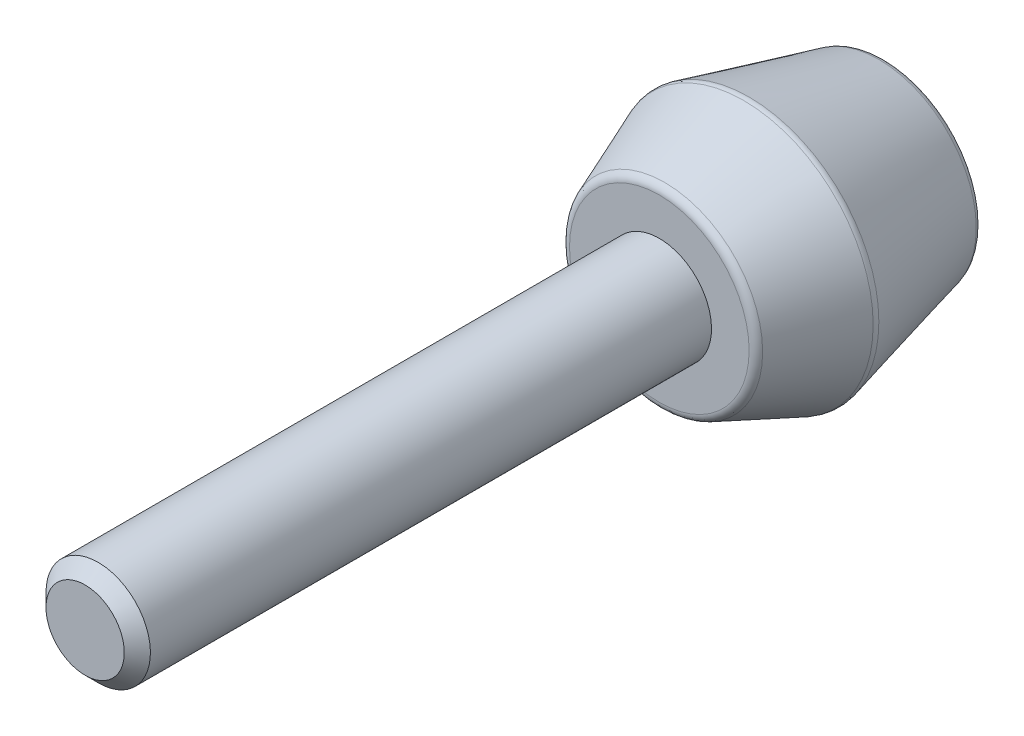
ISO-10303-21;
HEADER;
FILE_DESCRIPTION(('STEP AP214'),'2;1');
FILE_NAME('part.step','',(''),(''),'','','');
FILE_SCHEMA(('AUTOMOTIVE_DESIGN { 1 0 10303 214 1 1 1 1 }'));
ENDSEC;
DATA;
#1=APPLICATION_CONTEXT('core data for automotive mechanical design processes');
#2=APPLICATION_PROTOCOL_DEFINITION('international standard','automotive_design',2000,#1);
#3=PRODUCT_CONTEXT('',#1,'mechanical');
#4=PRODUCT('Part','Part','',(#3));
#5=PRODUCT_RELATED_PRODUCT_CATEGORY('part','',(#4));
#6=PRODUCT_DEFINITION_FORMATION('','',#4);
#7=PRODUCT_DEFINITION_CONTEXT('part definition',#1,'design');
#8=PRODUCT_DEFINITION('design','',#6,#7);
#9=PRODUCT_DEFINITION_SHAPE('','',#8);
#10=(LENGTH_UNIT() NAMED_UNIT(*) SI_UNIT(.MILLI.,.METRE.));
#11=(NAMED_UNIT(*) PLANE_ANGLE_UNIT() SI_UNIT($,.RADIAN.));
#12=(NAMED_UNIT(*) SI_UNIT($,.STERADIAN.) SOLID_ANGLE_UNIT());
#13=UNCERTAINTY_MEASURE_WITH_UNIT(LENGTH_MEASURE(1.E-05),#10,'distance_accuracy_value','');
#14=(GEOMETRIC_REPRESENTATION_CONTEXT(3) GLOBAL_UNCERTAINTY_ASSIGNED_CONTEXT((#13)) GLOBAL_UNIT_ASSIGNED_CONTEXT((#10,
#11,#12)) REPRESENTATION_CONTEXT('',''));
#15=CARTESIAN_POINT('',(0.,0.,0.));
#16=DIRECTION('',(0.,0.,1.));
#17=DIRECTION('',(1.,0.,0.));
#18=AXIS2_PLACEMENT_3D('',#15,#16,#17);
#19=CARTESIAN_POINT('',(0.,0.,0.));
#20=DIRECTION('',(0.,0.,-1.));
#21=DIRECTION('',(0.,1.,0.));
#22=AXIS2_PLACEMENT_3D('',#19,#20,#21);
#23=PLANE('',#22);
#24=CARTESIAN_POINT('',(0.,0.,0.));
#25=DIRECTION('',(0.,0.,1.));
#26=DIRECTION('',(0.,1.,0.));
#27=AXIS2_PLACEMENT_3D('',#24,#25,#26);
#28=CIRCLE('',#27,5.10961179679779);
#29=CARTESIAN_POINT('',(0.,5.10961179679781,0.));
#30=VERTEX_POINT('',#29);
#31=CARTESIAN_POINT('',(0.,-5.10961179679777,0.));
#32=VERTEX_POINT('',#31);
#33=EDGE_CURVE('E46',#30,#32,#28,.T.);
#34=ORIENTED_EDGE('',*,*,#33,.F.);
#35=CARTESIAN_POINT('',(0.,0.,0.));
#36=DIRECTION('',(0.,0.,1.));
#37=DIRECTION('',(0.,-1.,0.));
#38=AXIS2_PLACEMENT_3D('',#35,#36,#37);
#39=CIRCLE('',#38,5.10961179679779);
#40=EDGE_CURVE('E42',#32,#30,#39,.T.);
#41=ORIENTED_EDGE('',*,*,#40,.F.);
#42=EDGE_LOOP('',(#34,#41));
#43=FACE_BOUND('',#42,.T.);
#44=ADVANCED_FACE('F14',(#43),#23,.T.);
#45=CARTESIAN_POINT('',(0.,0.,0.499999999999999));
#46=DIRECTION('',(0.,0.,-1.));
#47=DIRECTION('',(0.,1.,0.));
#48=AXIS2_PLACEMENT_3D('',#45,#46,#47);
#49=TOROIDAL_SURFACE('',#48,5.10961179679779,0.5);
#50=CARTESIAN_POINT('',(0.,0.,0.378732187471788));
#51=DIRECTION('',(0.,0.,1.));
#52=DIRECTION('',(0.,-1.,0.));
#53=AXIS2_PLACEMENT_3D('',#50,#51,#52);
#54=CIRCLE('',#53,5.59468304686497);
#55=CARTESIAN_POINT('',(0.,-5.59468304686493,0.37873218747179));
#56=VERTEX_POINT('',#55);
#57=EDGE_CURVE('E52',#56,#56,#54,.T.);
#58=ORIENTED_EDGE('',*,*,#57,.F.);
#59=EDGE_LOOP('',(#58));
#60=FACE_BOUND('',#59,.T.);
#61=ORIENTED_EDGE('',*,*,#33,.T.);
#62=ORIENTED_EDGE('',*,*,#40,.T.);
#63=EDGE_LOOP('',(#61,#62));
#64=FACE_BOUND('',#63,.T.);
#65=ADVANCED_FACE('F51',(#60,#64),#49,.T.);
#66=CARTESIAN_POINT('',(0.,0.,7.84315022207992));
#67=DIRECTION('',(0.,0.,1.));
#68=DIRECTION('',(0.,-1.,0.));
#69=AXIS2_PLACEMENT_3D('',#66,#67,#68);
#70=CONICAL_SURFACE('',#69,7.46078755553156,0.244978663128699);
#71=ORIENTED_EDGE('',*,*,#57,.T.);
#72=EDGE_LOOP('',(#71));
#73=FACE_BOUND('',#72,.T.);
#74=CARTESIAN_POINT('',(0.,0.,7.84315022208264));
#75=DIRECTION('',(0.,0.,-1.));
#76=DIRECTION('',(0.,1.,0.));
#77=AXIS2_PLACEMENT_3D('',#74,#75,#76);
#78=CIRCLE('',#77,7.46078755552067);
#79=CARTESIAN_POINT('',(0.,7.4607875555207,7.84315022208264));
#80=VERTEX_POINT('',#79);
#81=EDGE_CURVE('E84',#80,#80,#78,.F.);
#82=ORIENTED_EDGE('',*,*,#81,.F.);
#83=EDGE_LOOP('',(#82));
#84=FACE_BOUND('',#83,.T.);
#85=ADVANCED_FACE('F69',(#73,#84),#70,.T.);
#86=CARTESIAN_POINT('',(0.,0.,7.96441803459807));
#87=DIRECTION('',(0.,0.,-1.));
#88=DIRECTION('',(0.,1.,0.));
#89=AXIS2_PLACEMENT_3D('',#86,#87,#88);
#90=TOROIDAL_SURFACE('',#89,6.97571630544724,0.500000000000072);
#91=CARTESIAN_POINT('',(0.,0.,8.15011337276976));
#92=DIRECTION('',(0.,0.,-1.));
#93=DIRECTION('',(0.,1.,0.));
#94=AXIS2_PLACEMENT_3D('',#91,#92,#93);
#95=CIRCLE('',#94,7.43995465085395);
#96=CARTESIAN_POINT('',(0.,7.43995465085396,8.15011337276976));
#97=VERTEX_POINT('',#96);
#98=EDGE_CURVE('E87',#97,#97,#95,.F.);
#99=ORIENTED_EDGE('',*,*,#98,.F.);
#100=EDGE_LOOP('',(#99));
#101=FACE_BOUND('',#100,.T.);
#102=ORIENTED_EDGE('',*,*,#81,.T.);
#103=EDGE_LOOP('',(#102));
#104=FACE_BOUND('',#103,.T.);
#105=ADVANCED_FACE('F94',(#101,#104),#90,.T.);
#106=CARTESIAN_POINT('',(0.,0.,8.15011337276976));
#107=DIRECTION('',(0.,0.,-1.));
#108=DIRECTION('',(0.,1.,0.));
#109=AXIS2_PLACEMENT_3D('',#106,#107,#108);
#110=CONICAL_SURFACE('',#109,7.43995465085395,0.380506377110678);
#111=CARTESIAN_POINT('',(0.,0.,12.6856953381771));
#112=DIRECTION('',(0.,0.,-1.));
#113=DIRECTION('',(-1.,0.,0.));
#114=AXIS2_PLACEMENT_3D('',#111,#112,#113);
#115=CIRCLE('',#114,5.62572186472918);
#116=CARTESIAN_POINT('',(-5.62572186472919,0.,12.6856953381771));
#117=VERTEX_POINT('',#116);
#118=EDGE_CURVE('E90',#117,#117,#115,.F.);
#119=ORIENTED_EDGE('',*,*,#118,.F.);
#120=EDGE_LOOP('',(#119));
#121=FACE_BOUND('',#120,.T.);
#122=ORIENTED_EDGE('',*,*,#98,.T.);
#123=EDGE_LOOP('',(#122));
#124=FACE_BOUND('',#123,.T.);
#125=ADVANCED_FACE('F97',(#121,#124),#110,.T.);
#126=CARTESIAN_POINT('',(0.,0.,12.5));
#127=DIRECTION('',(0.,0.,-1.));
#128=DIRECTION('',(-1.,0.,0.));
#129=AXIS2_PLACEMENT_3D('',#126,#127,#128);
#130=TOROIDAL_SURFACE('',#129,5.16148351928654,0.5);
#131=ORIENTED_EDGE('',*,*,#118,.T.);
#132=EDGE_LOOP('',(#131));
#133=FACE_BOUND('',#132,.T.);
#134=CARTESIAN_POINT('',(0.,0.,13.));
#135=DIRECTION('',(0.,0.,-1.));
#136=DIRECTION('',(-1.,0.,0.));
#137=AXIS2_PLACEMENT_3D('',#134,#135,#136);
#138=CIRCLE('',#137,5.16148351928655);
#139=CARTESIAN_POINT('',(-5.16148351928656,0.,13.));
#140=VERTEX_POINT('',#139);
#141=CARTESIAN_POINT('',(5.16148351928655,0.,13.));
#142=VERTEX_POINT('',#141);
#143=EDGE_CURVE('E115',#140,#142,#138,.T.);
#144=ORIENTED_EDGE('',*,*,#143,.T.);
#145=CARTESIAN_POINT('',(0.,0.,13.));
#146=DIRECTION('',(0.,0.,-1.));
#147=DIRECTION('',(1.,0.,0.));
#148=AXIS2_PLACEMENT_3D('',#145,#146,#147);
#149=CIRCLE('',#148,5.16148351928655);
#150=EDGE_CURVE('E33',#142,#140,#149,.T.);
#151=ORIENTED_EDGE('',*,*,#150,.T.);
#152=EDGE_LOOP('',(#144,#151));
#153=FACE_BOUND('',#152,.T.);
#154=ADVANCED_FACE('F101',(#133,#153),#130,.T.);
#155=CARTESIAN_POINT('',(0.,0.,46.));
#156=DIRECTION('',(0.,0.,1.));
#157=DIRECTION('',(1.,0.,0.));
#158=AXIS2_PLACEMENT_3D('',#155,#156,#157);
#159=PLANE('',#158);
#160=CARTESIAN_POINT('',(0.,0.,45.9999999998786));
#161=DIRECTION('',(0.,0.,-1.));
#162=DIRECTION('',(-1.,0.,0.));
#163=AXIS2_PLACEMENT_3D('',#160,#161,#162);
#164=CIRCLE('',#163,2.25000000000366);
#165=CARTESIAN_POINT('',(-2.25000000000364,0.,45.9999999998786));
#166=VERTEX_POINT('',#165);
#167=EDGE_CURVE('E125',#166,#166,#164,.T.);
#168=ORIENTED_EDGE('',*,*,#167,.F.);
#169=EDGE_LOOP('',(#168));
#170=FACE_BOUND('',#169,.T.);
#171=ADVANCED_FACE('F107',(#170),#159,.T.);
#172=CARTESIAN_POINT('',(0.,0.,13.));
#173=DIRECTION('',(0.,0.,-1.));
#174=DIRECTION('',(0.,1.,0.));
#175=AXIS2_PLACEMENT_3D('',#172,#173,#174);
#176=PLANE('',#175);
#177=CARTESIAN_POINT('',(0.,0.,13.));
#178=DIRECTION('',(0.,0.,1.));
#179=DIRECTION('',(0.,-1.,0.));
#180=AXIS2_PLACEMENT_3D('',#177,#178,#179);
#181=CIRCLE('',#180,3.);
#182=CARTESIAN_POINT('',(0.,-2.99999999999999,13.));
#183=VERTEX_POINT('',#182);
#184=EDGE_CURVE('E25',#183,#183,#181,.T.);
#185=ORIENTED_EDGE('',*,*,#184,.F.);
#186=EDGE_LOOP('',(#185));
#187=FACE_BOUND('',#186,.T.);
#188=ORIENTED_EDGE('',*,*,#150,.F.);
#189=ORIENTED_EDGE('',*,*,#143,.F.);
#190=EDGE_LOOP('',(#188,#189));
#191=FACE_BOUND('',#190,.T.);
#192=ADVANCED_FACE('F127',(#187,#191),#176,.F.);
#193=CARTESIAN_POINT('',(0.,0.,45.2499999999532));
#194=DIRECTION('',(0.,0.,-1.));
#195=DIRECTION('',(-1.,0.,0.));
#196=AXIS2_PLACEMENT_3D('',#193,#194,#195);
#197=CONICAL_SURFACE('',#196,2.99999999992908,0.785398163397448);
#198=ORIENTED_EDGE('',*,*,#167,.T.);
#199=EDGE_LOOP('',(#198));
#200=FACE_BOUND('',#199,.T.);
#201=CARTESIAN_POINT('',(0.,0.,45.25));
#202=DIRECTION('',(0.,0.,1.));
#203=DIRECTION('',(0.,-1.,0.));
#204=AXIS2_PLACEMENT_3D('',#201,#202,#203);
#205=CIRCLE('',#204,3.);
#206=CARTESIAN_POINT('',(0.,-3.,45.25));
#207=VERTEX_POINT('',#206);
#208=EDGE_CURVE('E9',#207,#207,#205,.F.);
#209=ORIENTED_EDGE('',*,*,#208,.F.);
#210=EDGE_LOOP('',(#209));
#211=FACE_BOUND('',#210,.T.);
#212=ADVANCED_FACE('F140',(#200,#211),#197,.T.);
#213=CARTESIAN_POINT('',(0.,0.,2.5));
#214=DIRECTION('',(0.,0.,1.));
#215=DIRECTION('',(0.,-1.,0.));
#216=AXIS2_PLACEMENT_3D('',#213,#214,#215);
#217=CYLINDRICAL_SURFACE('',#216,3.);
#218=ORIENTED_EDGE('',*,*,#208,.T.);
#219=EDGE_LOOP('',(#218));
#220=FACE_BOUND('',#219,.T.);
#221=ORIENTED_EDGE('',*,*,#184,.T.);
#222=EDGE_LOOP('',(#221));
#223=FACE_BOUND('',#222,.T.);
#224=ADVANCED_FACE('F152',(#220,#223),#217,.T.);
#225=CLOSED_SHELL('',(#44,#65,#85,#105,#125,#154,#171,#192,#212,#224));
#226=MANIFOLD_SOLID_BREP('B1',#225);
#227=ADVANCED_BREP_SHAPE_REPRESENTATION('',(#18,#226),#14);
#228=SHAPE_DEFINITION_REPRESENTATION(#9,#227);
ENDSEC;
END-ISO-10303-21;
